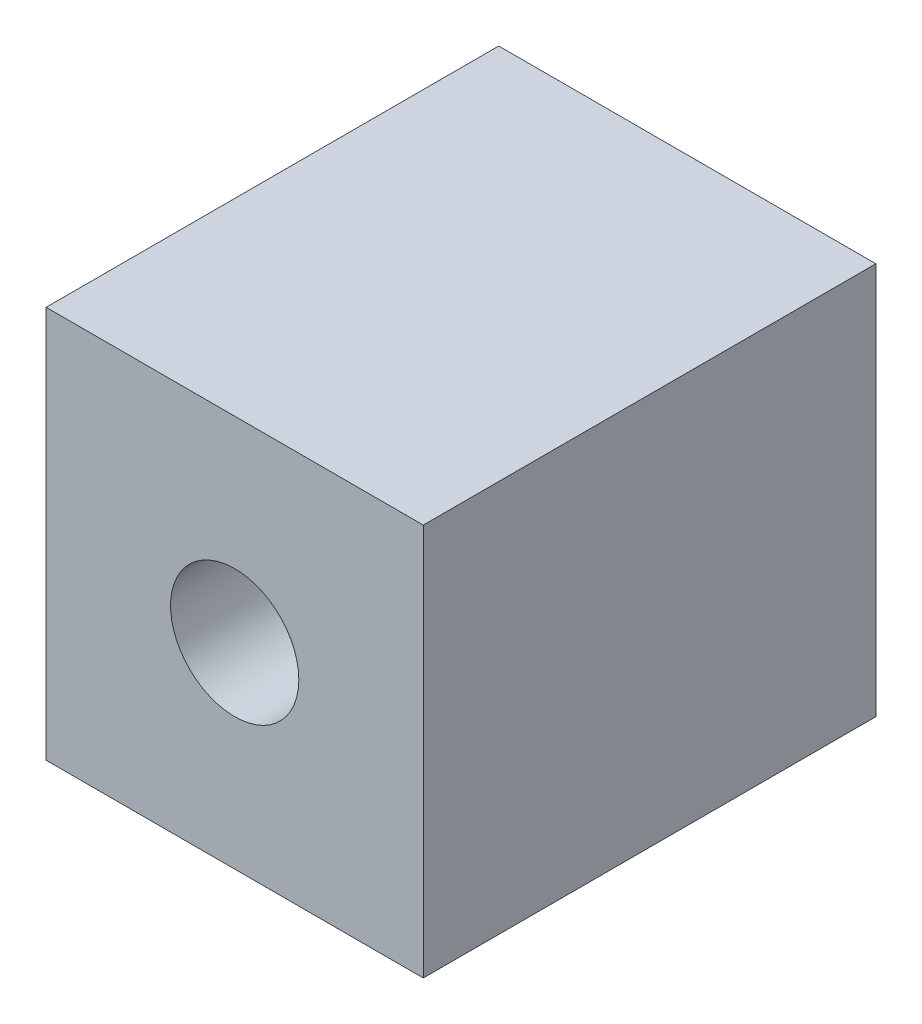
ISO-10303-21;
HEADER;
FILE_DESCRIPTION(('STEP AP214'),'2;1');
FILE_NAME('part.step','',(''),(''),'','','');
FILE_SCHEMA(('AUTOMOTIVE_DESIGN { 1 0 10303 214 1 1 1 1 }'));
ENDSEC;
DATA;
#1=APPLICATION_CONTEXT('core data for automotive mechanical design processes');
#2=APPLICATION_PROTOCOL_DEFINITION('international standard','automotive_design',2000,#1);
#3=PRODUCT_CONTEXT('',#1,'mechanical');
#4=PRODUCT('Part','Part','',(#3));
#5=PRODUCT_RELATED_PRODUCT_CATEGORY('part','',(#4));
#6=PRODUCT_DEFINITION_FORMATION('','',#4);
#7=PRODUCT_DEFINITION_CONTEXT('part definition',#1,'design');
#8=PRODUCT_DEFINITION('design','',#6,#7);
#9=PRODUCT_DEFINITION_SHAPE('','',#8);
#10=(LENGTH_UNIT() NAMED_UNIT(*) SI_UNIT(.MILLI.,.METRE.));
#11=(NAMED_UNIT(*) PLANE_ANGLE_UNIT() SI_UNIT($,.RADIAN.));
#12=(NAMED_UNIT(*) SI_UNIT($,.STERADIAN.) SOLID_ANGLE_UNIT());
#13=UNCERTAINTY_MEASURE_WITH_UNIT(LENGTH_MEASURE(1.E-05),#10,'distance_accuracy_value','');
#14=(GEOMETRIC_REPRESENTATION_CONTEXT(3) GLOBAL_UNCERTAINTY_ASSIGNED_CONTEXT((#13)) GLOBAL_UNIT_ASSIGNED_CONTEXT((#10,
#11,#12)) REPRESENTATION_CONTEXT('',''));
#15=CARTESIAN_POINT('',(0.,0.,0.));
#16=DIRECTION('',(0.,0.,1.));
#17=DIRECTION('',(1.,0.,0.));
#18=AXIS2_PLACEMENT_3D('',#15,#16,#17);
#19=CARTESIAN_POINT('',(0.,0.,30.));
#20=DIRECTION('',(1.,0.,0.));
#21=DIRECTION('',(0.,1.,0.));
#22=AXIS2_PLACEMENT_3D('',#19,#20,#21);
#23=PLANE('',#22);
#24=DIRECTION('',(0.,-1.,0.));
#25=VECTOR('',#24,1.);
#26=CARTESIAN_POINT('',(0.,0.,0.));
#27=LINE('',#26,#25);
#28=CARTESIAN_POINT('',(0.,26.,0.));
#29=VERTEX_POINT('',#28);
#30=CARTESIAN_POINT('',(0.,0.,0.));
#31=VERTEX_POINT('',#30);
#32=EDGE_CURVE('E82',#29,#31,#27,.T.);
#33=ORIENTED_EDGE('',*,*,#32,.T.);
#34=DIRECTION('',(0.,0.,-1.));
#35=VECTOR('',#34,1.);
#36=CARTESIAN_POINT('',(0.,0.,30.));
#37=LINE('',#36,#35);
#38=CARTESIAN_POINT('',(0.,0.,30.));
#39=VERTEX_POINT('',#38);
#40=EDGE_CURVE('E11',#39,#31,#37,.T.);
#41=ORIENTED_EDGE('',*,*,#40,.F.);
#42=DIRECTION('',(0.,-1.,0.));
#43=VECTOR('',#42,1.);
#44=CARTESIAN_POINT('',(0.,0.,30.));
#45=LINE('',#44,#43);
#46=CARTESIAN_POINT('',(0.,26.,30.));
#47=VERTEX_POINT('',#46);
#48=EDGE_CURVE('E93',#47,#39,#45,.T.);
#49=ORIENTED_EDGE('',*,*,#48,.F.);
#50=DIRECTION('',(0.,0.,-1.));
#51=VECTOR('',#50,1.);
#52=CARTESIAN_POINT('',(0.,26.,30.));
#53=LINE('',#52,#51);
#54=EDGE_CURVE('E99',#47,#29,#53,.T.);
#55=ORIENTED_EDGE('',*,*,#54,.T.);
#56=EDGE_LOOP('',(#33,#41,#49,#55));
#57=FACE_BOUND('',#56,.T.);
#58=ADVANCED_FACE('F29',(#57),#23,.F.);
#59=CARTESIAN_POINT('',(0.,0.,30.));
#60=DIRECTION('',(0.,1.,0.));
#61=DIRECTION('',(0.,0.,1.));
#62=AXIS2_PLACEMENT_3D('',#59,#60,#61);
#63=PLANE('',#62);
#64=DIRECTION('',(1.,0.,0.));
#65=VECTOR('',#64,1.);
#66=CARTESIAN_POINT('',(0.,0.,0.));
#67=LINE('',#66,#65);
#68=CARTESIAN_POINT('',(25.,0.,0.));
#69=VERTEX_POINT('',#68);
#70=EDGE_CURVE('E87',#31,#69,#67,.T.);
#71=ORIENTED_EDGE('',*,*,#70,.T.);
#72=DIRECTION('',(0.,0.,-1.));
#73=VECTOR('',#72,1.);
#74=CARTESIAN_POINT('',(25.,0.,30.));
#75=LINE('',#74,#73);
#76=CARTESIAN_POINT('',(25.,0.,30.));
#77=VERTEX_POINT('',#76);
#78=EDGE_CURVE('E36',#77,#69,#75,.T.);
#79=ORIENTED_EDGE('',*,*,#78,.F.);
#80=DIRECTION('',(1.,0.,0.));
#81=VECTOR('',#80,1.);
#82=CARTESIAN_POINT('',(0.,0.,30.));
#83=LINE('',#82,#81);
#84=EDGE_CURVE('E95',#39,#77,#83,.T.);
#85=ORIENTED_EDGE('',*,*,#84,.F.);
#86=ORIENTED_EDGE('',*,*,#40,.T.);
#87=EDGE_LOOP('',(#71,#79,#85,#86));
#88=FACE_BOUND('',#87,.T.);
#89=ADVANCED_FACE('F120',(#88),#63,.F.);
#90=CARTESIAN_POINT('',(25.,0.,30.));
#91=DIRECTION('',(-1.,0.,0.));
#92=DIRECTION('',(0.,-1.,0.));
#93=AXIS2_PLACEMENT_3D('',#90,#91,#92);
#94=PLANE('',#93);
#95=DIRECTION('',(0.,1.,0.));
#96=VECTOR('',#95,1.);
#97=CARTESIAN_POINT('',(25.,0.,0.));
#98=LINE('',#97,#96);
#99=CARTESIAN_POINT('',(25.,26.,0.));
#100=VERTEX_POINT('',#99);
#101=EDGE_CURVE('E89',#69,#100,#98,.T.);
#102=ORIENTED_EDGE('',*,*,#101,.T.);
#103=DIRECTION('',(0.,0.,-1.));
#104=VECTOR('',#103,1.);
#105=CARTESIAN_POINT('',(25.,26.,30.));
#106=LINE('',#105,#104);
#107=CARTESIAN_POINT('',(25.,26.,30.));
#108=VERTEX_POINT('',#107);
#109=EDGE_CURVE('E102',#108,#100,#106,.T.);
#110=ORIENTED_EDGE('',*,*,#109,.F.);
#111=DIRECTION('',(0.,1.,0.));
#112=VECTOR('',#111,1.);
#113=CARTESIAN_POINT('',(25.,0.,30.));
#114=LINE('',#113,#112);
#115=EDGE_CURVE('E48',#77,#108,#114,.T.);
#116=ORIENTED_EDGE('',*,*,#115,.F.);
#117=ORIENTED_EDGE('',*,*,#78,.T.);
#118=EDGE_LOOP('',(#102,#110,#116,#117));
#119=FACE_BOUND('',#118,.T.);
#120=ADVANCED_FACE('F108',(#119),#94,.F.);
#121=CARTESIAN_POINT('',(0.,26.,30.));
#122=DIRECTION('',(0.,-1.,0.));
#123=DIRECTION('',(0.,0.,-1.));
#124=AXIS2_PLACEMENT_3D('',#121,#122,#123);
#125=PLANE('',#124);
#126=DIRECTION('',(-1.,0.,0.));
#127=VECTOR('',#126,1.);
#128=CARTESIAN_POINT('',(0.,26.,0.));
#129=LINE('',#128,#127);
#130=EDGE_CURVE('E91',#100,#29,#129,.T.);
#131=ORIENTED_EDGE('',*,*,#130,.T.);
#132=ORIENTED_EDGE('',*,*,#54,.F.);
#133=DIRECTION('',(-1.,0.,0.));
#134=VECTOR('',#133,1.);
#135=CARTESIAN_POINT('',(0.,26.,30.));
#136=LINE('',#135,#134);
#137=EDGE_CURVE('E43',#108,#47,#136,.T.);
#138=ORIENTED_EDGE('',*,*,#137,.F.);
#139=ORIENTED_EDGE('',*,*,#109,.T.);
#140=EDGE_LOOP('',(#131,#132,#138,#139));
#141=FACE_BOUND('',#140,.T.);
#142=ADVANCED_FACE('F115',(#141),#125,.F.);
#143=CARTESIAN_POINT('',(0.,26.,30.));
#144=DIRECTION('',(0.,0.,-1.));
#145=DIRECTION('',(-1.,0.,0.));
#146=AXIS2_PLACEMENT_3D('',#143,#144,#145);
#147=PLANE('',#146);
#148=CARTESIAN_POINT('',(12.5,13.,30.));
#149=DIRECTION('',(0.,0.,1.));
#150=DIRECTION('',(1.,0.,0.));
#151=AXIS2_PLACEMENT_3D('',#148,#149,#150);
#152=CIRCLE('',#151,4.25);
#153=CARTESIAN_POINT('',(16.75,13.,30.));
#154=VERTEX_POINT('',#153);
#155=EDGE_CURVE('E79',#154,#154,#152,.T.);
#156=ORIENTED_EDGE('',*,*,#155,.F.);
#157=EDGE_LOOP('',(#156));
#158=FACE_BOUND('',#157,.T.);
#159=ORIENTED_EDGE('',*,*,#48,.T.);
#160=ORIENTED_EDGE('',*,*,#84,.T.);
#161=ORIENTED_EDGE('',*,*,#115,.T.);
#162=ORIENTED_EDGE('',*,*,#137,.T.);
#163=EDGE_LOOP('',(#159,#160,#161,#162));
#164=FACE_BOUND('',#163,.T.);
#165=ADVANCED_FACE('F119',(#158,#164),#147,.F.);
#166=CARTESIAN_POINT('',(0.,26.,0.));
#167=DIRECTION('',(0.,0.,-1.));
#168=DIRECTION('',(-1.,0.,0.));
#169=AXIS2_PLACEMENT_3D('',#166,#167,#168);
#170=PLANE('',#169);
#171=ORIENTED_EDGE('',*,*,#32,.F.);
#172=ORIENTED_EDGE('',*,*,#130,.F.);
#173=ORIENTED_EDGE('',*,*,#101,.F.);
#174=ORIENTED_EDGE('',*,*,#70,.F.);
#175=EDGE_LOOP('',(#171,#172,#173,#174));
#176=FACE_BOUND('',#175,.T.);
#177=ADVANCED_FACE('F113',(#176),#170,.T.);
#178=CARTESIAN_POINT('',(12.5,13.,30.));
#179=DIRECTION('',(0.,0.,1.));
#180=DIRECTION('',(1.,0.,0.));
#181=AXIS2_PLACEMENT_3D('',#178,#179,#180);
#182=CYLINDRICAL_SURFACE('',#181,4.25);
#183=CARTESIAN_POINT('',(12.5,13.,8.5));
#184=DIRECTION('',(0.,0.,1.));
#185=DIRECTION('',(1.,0.,0.));
#186=AXIS2_PLACEMENT_3D('',#183,#184,#185);
#187=CIRCLE('',#186,4.24999999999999);
#188=CARTESIAN_POINT('',(16.75,13.,8.5));
#189=VERTEX_POINT('',#188);
#190=EDGE_CURVE('E77',#189,#189,#187,.T.);
#191=ORIENTED_EDGE('',*,*,#190,.F.);
#192=EDGE_LOOP('',(#191));
#193=FACE_BOUND('',#192,.T.);
#194=ORIENTED_EDGE('',*,*,#155,.T.);
#195=EDGE_LOOP('',(#194));
#196=FACE_BOUND('',#195,.T.);
#197=ADVANCED_FACE('F73',(#193,#196),#182,.F.);
#198=CARTESIAN_POINT('',(12.5,13.,8.5));
#199=DIRECTION('',(0.,0.,1.));
#200=DIRECTION('',(1.,0.,0.));
#201=AXIS2_PLACEMENT_3D('',#198,#199,#200);
#202=CONICAL_SURFACE('',#201,4.24999999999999,1.02974425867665);
#203=CARTESIAN_POINT('',(12.5,13.,5.94634236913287));
#204=VERTEX_POINT('',#203);
#205=VERTEX_LOOP('',#204);
#206=FACE_BOUND('',#205,.T.);
#207=ORIENTED_EDGE('',*,*,#190,.T.);
#208=EDGE_LOOP('',(#207));
#209=FACE_BOUND('',#208,.T.);
#210=ADVANCED_FACE('F70',(#206,#209),#202,.F.);
#211=CLOSED_SHELL('',(#58,#89,#120,#142,#165,#177,#197,#210));
#212=MANIFOLD_SOLID_BREP('B2',#211);
#213=ADVANCED_BREP_SHAPE_REPRESENTATION('',(#18,#212),#14);
#214=SHAPE_DEFINITION_REPRESENTATION(#9,#213);
ENDSEC;
END-ISO-10303-21;
